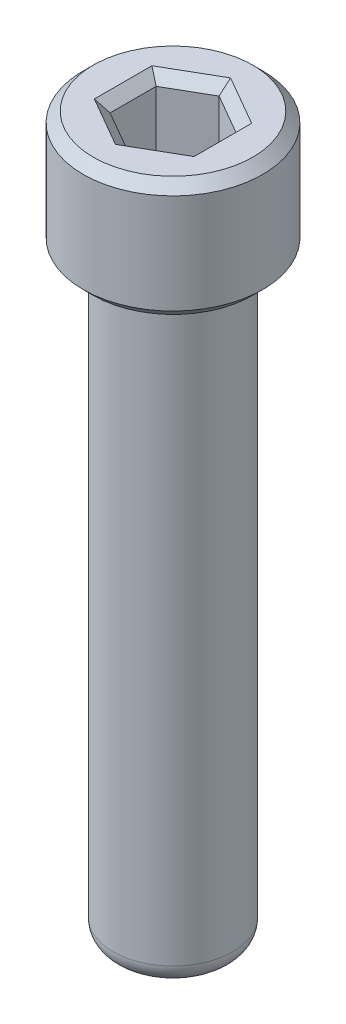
ISO-10303-21;
HEADER;
FILE_DESCRIPTION(('STEP AP214'),'2;1');
FILE_NAME('part.step','',(''),(''),'','','');
FILE_SCHEMA(('AUTOMOTIVE_DESIGN { 1 0 10303 214 1 1 1 1 }'));
ENDSEC;
DATA;
#1=APPLICATION_CONTEXT('core data for automotive mechanical design processes');
#2=APPLICATION_PROTOCOL_DEFINITION('international standard','automotive_design',2000,#1);
#3=PRODUCT_CONTEXT('',#1,'mechanical');
#4=PRODUCT('Part','Part','',(#3));
#5=PRODUCT_RELATED_PRODUCT_CATEGORY('part','',(#4));
#6=PRODUCT_DEFINITION_FORMATION('','',#4);
#7=PRODUCT_DEFINITION_CONTEXT('part definition',#1,'design');
#8=PRODUCT_DEFINITION('design','',#6,#7);
#9=PRODUCT_DEFINITION_SHAPE('','',#8);
#10=(LENGTH_UNIT() NAMED_UNIT(*) SI_UNIT(.MILLI.,.METRE.));
#11=(NAMED_UNIT(*) PLANE_ANGLE_UNIT() SI_UNIT($,.RADIAN.));
#12=(NAMED_UNIT(*) SI_UNIT($,.STERADIAN.) SOLID_ANGLE_UNIT());
#13=UNCERTAINTY_MEASURE_WITH_UNIT(LENGTH_MEASURE(1.E-05),#10,'distance_accuracy_value','');
#14=(GEOMETRIC_REPRESENTATION_CONTEXT(3) GLOBAL_UNCERTAINTY_ASSIGNED_CONTEXT((#13)) GLOBAL_UNIT_ASSIGNED_CONTEXT((#10,
#11,#12)) REPRESENTATION_CONTEXT('',''));
#15=CARTESIAN_POINT('',(0.,0.,0.));
#16=DIRECTION('',(0.,0.,1.));
#17=DIRECTION('',(1.,0.,0.));
#18=AXIS2_PLACEMENT_3D('',#15,#16,#17);
#19=CARTESIAN_POINT('',(0.,15.,0.));
#20=DIRECTION('',(0.,-1.,0.));
#21=DIRECTION('',(0.,0.,-1.));
#22=AXIS2_PLACEMENT_3D('',#19,#20,#21);
#23=CYLINDRICAL_SURFACE('',#22,1.5);
#24=CARTESIAN_POINT('',(0.,0.5,0.));
#25=DIRECTION('',(0.,1.,0.));
#26=DIRECTION('',(0.,0.,1.));
#27=AXIS2_PLACEMENT_3D('',#24,#25,#26);
#28=CIRCLE('',#27,1.5);
#29=CARTESIAN_POINT('',(0.,0.5,1.5));
#30=VERTEX_POINT('',#29);
#31=EDGE_CURVE('E56',#30,#30,#28,.T.);
#32=ORIENTED_EDGE('',*,*,#31,.T.);
#33=EDGE_LOOP('',(#32));
#34=FACE_BOUND('',#33,.T.);
#35=CARTESIAN_POINT('',(0.,15.,0.));
#36=DIRECTION('',(0.,1.,0.));
#37=DIRECTION('',(0.,0.,1.));
#38=AXIS2_PLACEMENT_3D('',#35,#36,#37);
#39=CIRCLE('',#38,1.5);
#40=CARTESIAN_POINT('',(0.,15.,1.5));
#41=VERTEX_POINT('',#40);
#42=EDGE_CURVE('E169',#41,#41,#39,.T.);
#43=ORIENTED_EDGE('',*,*,#42,.F.);
#44=EDGE_LOOP('',(#43));
#45=FACE_BOUND('',#44,.T.);
#46=ADVANCED_FACE('F47',(#34,#45),#23,.T.);
#47=CARTESIAN_POINT('',(0.,0.,0.));
#48=DIRECTION('',(0.,1.,0.));
#49=DIRECTION('',(0.,0.,1.));
#50=AXIS2_PLACEMENT_3D('',#47,#48,#49);
#51=PLANE('',#50);
#52=CARTESIAN_POINT('',(0.,0.,0.));
#53=DIRECTION('',(0.,1.,0.));
#54=DIRECTION('',(0.,0.,1.));
#55=AXIS2_PLACEMENT_3D('',#52,#53,#54);
#56=CIRCLE('',#55,1.);
#57=CARTESIAN_POINT('',(0.,0.,1.));
#58=VERTEX_POINT('',#57);
#59=EDGE_CURVE('E11',#58,#58,#56,.F.);
#60=ORIENTED_EDGE('',*,*,#59,.T.);
#61=EDGE_LOOP('',(#60));
#62=FACE_BOUND('',#61,.T.);
#63=ADVANCED_FACE('F270',(#62),#51,.F.);
#64=CARTESIAN_POINT('',(0.,18.,0.));
#65=DIRECTION('',(0.,-1.,0.));
#66=DIRECTION('',(0.,0.,-1.));
#67=AXIS2_PLACEMENT_3D('',#64,#65,#66);
#68=CYLINDRICAL_SURFACE('',#67,2.25);
#69=CARTESIAN_POINT('',(0.,15.25,0.));
#70=DIRECTION('',(0.,1.,0.));
#71=DIRECTION('',(0.,0.,1.));
#72=AXIS2_PLACEMENT_3D('',#69,#70,#71);
#73=CIRCLE('',#72,2.25);
#74=CARTESIAN_POINT('',(0.,15.25,2.25));
#75=VERTEX_POINT('',#74);
#76=EDGE_CURVE('E189',#75,#75,#73,.T.);
#77=ORIENTED_EDGE('',*,*,#76,.T.);
#78=EDGE_LOOP('',(#77));
#79=FACE_BOUND('',#78,.T.);
#80=CARTESIAN_POINT('',(0.,17.75,0.));
#81=DIRECTION('',(0.,1.,0.));
#82=DIRECTION('',(0.,0.,1.));
#83=AXIS2_PLACEMENT_3D('',#80,#81,#82);
#84=CIRCLE('',#83,2.25);
#85=CARTESIAN_POINT('',(0.,17.75,2.25));
#86=VERTEX_POINT('',#85);
#87=EDGE_CURVE('E185',#86,#86,#84,.F.);
#88=ORIENTED_EDGE('',*,*,#87,.T.);
#89=EDGE_LOOP('',(#88));
#90=FACE_BOUND('',#89,.T.);
#91=ADVANCED_FACE('F274',(#79,#90),#68,.T.);
#92=CARTESIAN_POINT('',(0.,18.,0.));
#93=DIRECTION('',(0.,1.,0.));
#94=DIRECTION('',(0.,0.,1.));
#95=AXIS2_PLACEMENT_3D('',#92,#93,#94);
#96=PLANE('',#95);
#97=CARTESIAN_POINT('',(0.,18.,0.));
#98=DIRECTION('',(0.,1.,0.));
#99=DIRECTION('',(0.,0.,1.));
#100=AXIS2_PLACEMENT_3D('',#97,#98,#99);
#101=CIRCLE('',#100,2.);
#102=CARTESIAN_POINT('',(0.,18.,2.));
#103=VERTEX_POINT('',#102);
#104=EDGE_CURVE('E216',#103,#103,#101,.T.);
#105=ORIENTED_EDGE('',*,*,#104,.T.);
#106=EDGE_LOOP('',(#105));
#107=FACE_BOUND('',#106,.T.);
#108=DIRECTION('',(-0.866025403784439,0.,0.5));
#109=VECTOR('',#108,1.);
#110=CARTESIAN_POINT('',(0.124999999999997,18.,1.37120688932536));
#111=LINE('',#110,#109);
#112=CARTESIAN_POINT('',(1.25,18.,0.72168783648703));
#113=VERTEX_POINT('',#112);
#114=CARTESIAN_POINT('',(0.,18.,1.44337567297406));
#115=VERTEX_POINT('',#114);
#116=EDGE_CURVE('E197',#113,#115,#111,.T.);
#117=ORIENTED_EDGE('',*,*,#116,.T.);
#118=DIRECTION('',(-0.866025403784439,0.,-0.5));
#119=VECTOR('',#118,1.);
#120=CARTESIAN_POINT('',(-1.125,18.,0.793856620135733));
#121=LINE('',#120,#119);
#122=CARTESIAN_POINT('',(-1.25,18.,0.721687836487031));
#123=VERTEX_POINT('',#122);
#124=EDGE_CURVE('E212',#115,#123,#121,.T.);
#125=ORIENTED_EDGE('',*,*,#124,.T.);
#126=DIRECTION('',(0.,0.,-1.));
#127=VECTOR('',#126,1.);
#128=CARTESIAN_POINT('',(-1.25,18.,-0.577350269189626));
#129=LINE('',#128,#127);
#130=CARTESIAN_POINT('',(-1.25,18.,-0.721687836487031));
#131=VERTEX_POINT('',#130);
#132=EDGE_CURVE('E209',#123,#131,#129,.T.);
#133=ORIENTED_EDGE('',*,*,#132,.T.);
#134=DIRECTION('',(0.866025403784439,0.,-0.5));
#135=VECTOR('',#134,1.);
#136=CARTESIAN_POINT('',(-0.124999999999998,18.,-1.37120688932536));
#137=LINE('',#136,#135);
#138=CARTESIAN_POINT('',(0.,18.,-1.44337567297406));
#139=VERTEX_POINT('',#138);
#140=EDGE_CURVE('E206',#131,#139,#137,.T.);
#141=ORIENTED_EDGE('',*,*,#140,.T.);
#142=DIRECTION('',(0.866025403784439,0.,0.5));
#143=VECTOR('',#142,1.);
#144=CARTESIAN_POINT('',(1.125,18.,-0.793856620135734));
#145=LINE('',#144,#143);
#146=CARTESIAN_POINT('',(1.25,18.,-0.721687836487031));
#147=VERTEX_POINT('',#146);
#148=EDGE_CURVE('E203',#139,#147,#145,.T.);
#149=ORIENTED_EDGE('',*,*,#148,.T.);
#150=DIRECTION('',(0.,0.,1.));
#151=VECTOR('',#150,1.);
#152=CARTESIAN_POINT('',(1.25,18.,0.577350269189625));
#153=LINE('',#152,#151);
#154=EDGE_CURVE('E200',#147,#113,#153,.T.);
#155=ORIENTED_EDGE('',*,*,#154,.T.);
#156=EDGE_LOOP('',(#117,#125,#133,#141,#149,#155));
#157=FACE_BOUND('',#156,.T.);
#158=ADVANCED_FACE('F336',(#107,#157),#96,.T.);
#159=CARTESIAN_POINT('',(0.,15.,0.));
#160=DIRECTION('',(0.,1.,0.));
#161=DIRECTION('',(0.,0.,1.));
#162=AXIS2_PLACEMENT_3D('',#159,#160,#161);
#163=PLANE('',#162);
#164=CARTESIAN_POINT('',(0.,15.,0.));
#165=DIRECTION('',(0.,1.,0.));
#166=DIRECTION('',(0.,0.,1.));
#167=AXIS2_PLACEMENT_3D('',#164,#165,#166);
#168=CIRCLE('',#167,2.);
#169=CARTESIAN_POINT('',(0.,15.,2.));
#170=VERTEX_POINT('',#169);
#171=EDGE_CURVE('E193',#170,#170,#168,.F.);
#172=ORIENTED_EDGE('',*,*,#171,.T.);
#173=EDGE_LOOP('',(#172));
#174=FACE_BOUND('',#173,.T.);
#175=ORIENTED_EDGE('',*,*,#42,.T.);
#176=EDGE_LOOP('',(#175));
#177=FACE_BOUND('',#176,.T.);
#178=ADVANCED_FACE('F370',(#174,#177),#163,.F.);
#179=CARTESIAN_POINT('',(1.,16.,-0.577350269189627));
#180=DIRECTION('',(0.5,0.,-0.866025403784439));
#181=DIRECTION('',(-0.866025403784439,0.,-0.5));
#182=AXIS2_PLACEMENT_3D('',#179,#180,#181);
#183=PLANE('',#182);
#184=DIRECTION('',(0.,1.,0.));
#185=VECTOR('',#184,1.);
#186=CARTESIAN_POINT('',(1.,16.,-0.577350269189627));
#187=LINE('',#186,#185);
#188=CARTESIAN_POINT('',(1.,16.,-0.577350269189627));
#189=VERTEX_POINT('',#188);
#190=CARTESIAN_POINT('',(1.,17.75,-0.577350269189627));
#191=VERTEX_POINT('',#190);
#192=EDGE_CURVE('E166',#189,#191,#187,.T.);
#193=ORIENTED_EDGE('',*,*,#192,.T.);
#194=DIRECTION('',(-0.866025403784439,0.,-0.5));
#195=VECTOR('',#194,1.);
#196=CARTESIAN_POINT('',(0.,17.75,-1.15470053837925));
#197=LINE('',#196,#195);
#198=CARTESIAN_POINT('',(0.,17.75,-1.15470053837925));
#199=VERTEX_POINT('',#198);
#200=EDGE_CURVE('E127',#191,#199,#197,.T.);
#201=ORIENTED_EDGE('',*,*,#200,.T.);
#202=DIRECTION('',(0.,1.,0.));
#203=VECTOR('',#202,1.);
#204=CARTESIAN_POINT('',(0.,16.,-1.15470053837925));
#205=LINE('',#204,#203);
#206=CARTESIAN_POINT('',(0.,16.,-1.15470053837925));
#207=VERTEX_POINT('',#206);
#208=EDGE_CURVE('E120',#207,#199,#205,.T.);
#209=ORIENTED_EDGE('',*,*,#208,.F.);
#210=DIRECTION('',(-0.866025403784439,0.,-0.5));
#211=VECTOR('',#210,1.);
#212=CARTESIAN_POINT('',(1.,16.,-0.577350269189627));
#213=LINE('',#212,#211);
#214=EDGE_CURVE('E124',#189,#207,#213,.T.);
#215=ORIENTED_EDGE('',*,*,#214,.F.);
#216=EDGE_LOOP('',(#193,#201,#209,#215));
#217=FACE_BOUND('',#216,.T.);
#218=ADVANCED_FACE('F122',(#217),#183,.F.);
#219=CARTESIAN_POINT('',(1.,16.,0.577350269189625));
#220=DIRECTION('',(1.,0.,0.));
#221=DIRECTION('',(0.,0.,-1.));
#222=AXIS2_PLACEMENT_3D('',#219,#220,#221);
#223=PLANE('',#222);
#224=DIRECTION('',(0.,1.,0.));
#225=VECTOR('',#224,1.);
#226=CARTESIAN_POINT('',(1.,16.,0.577350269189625));
#227=LINE('',#226,#225);
#228=CARTESIAN_POINT('',(1.,16.,0.577350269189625));
#229=VERTEX_POINT('',#228);
#230=CARTESIAN_POINT('',(1.,17.75,0.577350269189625));
#231=VERTEX_POINT('',#230);
#232=EDGE_CURVE('E170',#229,#231,#227,.T.);
#233=ORIENTED_EDGE('',*,*,#232,.T.);
#234=DIRECTION('',(0.,0.,-1.));
#235=VECTOR('',#234,1.);
#236=CARTESIAN_POINT('',(1.,17.75,-0.577350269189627));
#237=LINE('',#236,#235);
#238=EDGE_CURVE('E70',#231,#191,#237,.T.);
#239=ORIENTED_EDGE('',*,*,#238,.T.);
#240=ORIENTED_EDGE('',*,*,#192,.F.);
#241=DIRECTION('',(0.,0.,-1.));
#242=VECTOR('',#241,1.);
#243=CARTESIAN_POINT('',(1.,16.,0.577350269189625));
#244=LINE('',#243,#242);
#245=EDGE_CURVE('E132',#229,#189,#244,.T.);
#246=ORIENTED_EDGE('',*,*,#245,.F.);
#247=EDGE_LOOP('',(#233,#239,#240,#246));
#248=FACE_BOUND('',#247,.T.);
#249=ADVANCED_FACE('F351',(#248),#223,.F.);
#250=CARTESIAN_POINT('',(0.,16.,1.15470053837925));
#251=DIRECTION('',(0.5,0.,0.866025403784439));
#252=DIRECTION('',(0.866025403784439,0.,-0.5));
#253=AXIS2_PLACEMENT_3D('',#250,#251,#252);
#254=PLANE('',#253);
#255=DIRECTION('',(0.,1.,0.));
#256=VECTOR('',#255,1.);
#257=CARTESIAN_POINT('',(0.,16.,1.15470053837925));
#258=LINE('',#257,#256);
#259=CARTESIAN_POINT('',(0.,16.,1.15470053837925));
#260=VERTEX_POINT('',#259);
#261=CARTESIAN_POINT('',(0.,17.75,1.15470053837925));
#262=VERTEX_POINT('',#261);
#263=EDGE_CURVE('E173',#260,#262,#258,.T.);
#264=ORIENTED_EDGE('',*,*,#263,.T.);
#265=DIRECTION('',(0.866025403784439,0.,-0.5));
#266=VECTOR('',#265,1.);
#267=CARTESIAN_POINT('',(1.,17.75,0.577350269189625));
#268=LINE('',#267,#266);
#269=EDGE_CURVE('E63',#262,#231,#268,.T.);
#270=ORIENTED_EDGE('',*,*,#269,.T.);
#271=ORIENTED_EDGE('',*,*,#232,.F.);
#272=DIRECTION('',(0.866025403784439,0.,-0.5));
#273=VECTOR('',#272,1.);
#274=CARTESIAN_POINT('',(0.,16.,1.15470053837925));
#275=LINE('',#274,#273);
#276=EDGE_CURVE('E161',#260,#229,#275,.T.);
#277=ORIENTED_EDGE('',*,*,#276,.F.);
#278=EDGE_LOOP('',(#264,#270,#271,#277));
#279=FACE_BOUND('',#278,.T.);
#280=ADVANCED_FACE('F353',(#279),#254,.F.);
#281=CARTESIAN_POINT('',(-1.,16.,0.577350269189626));
#282=DIRECTION('',(-0.5,0.,0.866025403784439));
#283=DIRECTION('',(0.866025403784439,0.,0.5));
#284=AXIS2_PLACEMENT_3D('',#281,#282,#283);
#285=PLANE('',#284);
#286=DIRECTION('',(0.,1.,0.));
#287=VECTOR('',#286,1.);
#288=CARTESIAN_POINT('',(-1.,16.,0.577350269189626));
#289=LINE('',#288,#287);
#290=CARTESIAN_POINT('',(-1.,16.,0.577350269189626));
#291=VERTEX_POINT('',#290);
#292=CARTESIAN_POINT('',(-1.,17.75,0.577350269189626));
#293=VERTEX_POINT('',#292);
#294=EDGE_CURVE('E176',#291,#293,#289,.T.);
#295=ORIENTED_EDGE('',*,*,#294,.T.);
#296=DIRECTION('',(0.866025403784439,0.,0.5));
#297=VECTOR('',#296,1.);
#298=CARTESIAN_POINT('',(0.,17.75,1.15470053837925));
#299=LINE('',#298,#297);
#300=EDGE_CURVE('E220',#293,#262,#299,.T.);
#301=ORIENTED_EDGE('',*,*,#300,.T.);
#302=ORIENTED_EDGE('',*,*,#263,.F.);
#303=DIRECTION('',(0.866025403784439,0.,0.5));
#304=VECTOR('',#303,1.);
#305=CARTESIAN_POINT('',(-1.,16.,0.577350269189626));
#306=LINE('',#305,#304);
#307=EDGE_CURVE('E157',#291,#260,#306,.T.);
#308=ORIENTED_EDGE('',*,*,#307,.F.);
#309=EDGE_LOOP('',(#295,#301,#302,#308));
#310=FACE_BOUND('',#309,.T.);
#311=ADVANCED_FACE('F349',(#310),#285,.F.);
#312=CARTESIAN_POINT('',(-1.,16.,-0.577350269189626));
#313=DIRECTION('',(-1.,0.,0.));
#314=DIRECTION('',(0.,0.,1.));
#315=AXIS2_PLACEMENT_3D('',#312,#313,#314);
#316=PLANE('',#315);
#317=DIRECTION('',(0.,1.,0.));
#318=VECTOR('',#317,1.);
#319=CARTESIAN_POINT('',(-1.,16.,-0.577350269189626));
#320=LINE('',#319,#318);
#321=CARTESIAN_POINT('',(-1.,16.,-0.577350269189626));
#322=VERTEX_POINT('',#321);
#323=CARTESIAN_POINT('',(-1.,17.75,-0.577350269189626));
#324=VERTEX_POINT('',#323);
#325=EDGE_CURVE('E131',#322,#324,#320,.T.);
#326=ORIENTED_EDGE('',*,*,#325,.T.);
#327=DIRECTION('',(0.,0.,1.));
#328=VECTOR('',#327,1.);
#329=CARTESIAN_POINT('',(-1.,17.75,0.577350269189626));
#330=LINE('',#329,#328);
#331=EDGE_CURVE('E224',#324,#293,#330,.T.);
#332=ORIENTED_EDGE('',*,*,#331,.T.);
#333=ORIENTED_EDGE('',*,*,#294,.F.);
#334=DIRECTION('',(0.,0.,1.));
#335=VECTOR('',#334,1.);
#336=CARTESIAN_POINT('',(-1.,16.,-0.577350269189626));
#337=LINE('',#336,#335);
#338=EDGE_CURVE('E142',#322,#291,#337,.T.);
#339=ORIENTED_EDGE('',*,*,#338,.F.);
#340=EDGE_LOOP('',(#326,#332,#333,#339));
#341=FACE_BOUND('',#340,.T.);
#342=ADVANCED_FACE('F346',(#341),#316,.F.);
#343=CARTESIAN_POINT('',(0.,16.,-1.15470053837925));
#344=DIRECTION('',(-0.5,0.,-0.866025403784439));
#345=DIRECTION('',(-0.866025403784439,0.,0.5));
#346=AXIS2_PLACEMENT_3D('',#343,#344,#345);
#347=PLANE('',#346);
#348=ORIENTED_EDGE('',*,*,#208,.T.);
#349=DIRECTION('',(-0.866025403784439,0.,0.5));
#350=VECTOR('',#349,1.);
#351=CARTESIAN_POINT('',(-1.,17.75,-0.577350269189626));
#352=LINE('',#351,#350);
#353=EDGE_CURVE('E227',#199,#324,#352,.T.);
#354=ORIENTED_EDGE('',*,*,#353,.T.);
#355=ORIENTED_EDGE('',*,*,#325,.F.);
#356=DIRECTION('',(-0.866025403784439,0.,0.5));
#357=VECTOR('',#356,1.);
#358=CARTESIAN_POINT('',(0.,16.,-1.15470053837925));
#359=LINE('',#358,#357);
#360=EDGE_CURVE('E135',#207,#322,#359,.T.);
#361=ORIENTED_EDGE('',*,*,#360,.F.);
#362=EDGE_LOOP('',(#348,#354,#355,#361));
#363=FACE_BOUND('',#362,.T.);
#364=ADVANCED_FACE('F136',(#363),#347,.F.);
#365=CARTESIAN_POINT('',(0.,16.,0.));
#366=DIRECTION('',(0.,1.,0.));
#367=DIRECTION('',(0.,0.,1.));
#368=AXIS2_PLACEMENT_3D('',#365,#366,#367);
#369=PLANE('',#368);
#370=ORIENTED_EDGE('',*,*,#214,.T.);
#371=ORIENTED_EDGE('',*,*,#360,.T.);
#372=ORIENTED_EDGE('',*,*,#338,.T.);
#373=ORIENTED_EDGE('',*,*,#307,.T.);
#374=ORIENTED_EDGE('',*,*,#276,.T.);
#375=ORIENTED_EDGE('',*,*,#245,.T.);
#376=EDGE_LOOP('',(#370,#371,#372,#373,#374,#375));
#377=FACE_BOUND('',#376,.T.);
#378=ADVANCED_FACE('F144',(#377),#369,.T.);
#379=CARTESIAN_POINT('',(0.,15.25,0.));
#380=DIRECTION('',(0.,1.,0.));
#381=DIRECTION('',(0.,0.,1.));
#382=AXIS2_PLACEMENT_3D('',#379,#380,#381);
#383=CONICAL_SURFACE('',#382,2.25,0.785398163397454);
#384=ORIENTED_EDGE('',*,*,#171,.F.);
#385=EDGE_LOOP('',(#384));
#386=FACE_BOUND('',#385,.T.);
#387=ORIENTED_EDGE('',*,*,#76,.F.);
#388=EDGE_LOOP('',(#387));
#389=FACE_BOUND('',#388,.T.);
#390=ADVANCED_FACE('F280',(#386,#389),#383,.T.);
#391=CARTESIAN_POINT('',(0.,18.,0.));
#392=DIRECTION('',(0.,-1.,0.));
#393=DIRECTION('',(0.,0.,-1.));
#394=AXIS2_PLACEMENT_3D('',#391,#392,#393);
#395=CONICAL_SURFACE('',#394,2.,0.785398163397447);
#396=ORIENTED_EDGE('',*,*,#87,.F.);
#397=EDGE_LOOP('',(#396));
#398=FACE_BOUND('',#397,.T.);
#399=ORIENTED_EDGE('',*,*,#104,.F.);
#400=EDGE_LOOP('',(#399));
#401=FACE_BOUND('',#400,.T.);
#402=ADVANCED_FACE('F286',(#398,#401),#395,.T.);
#403=CARTESIAN_POINT('',(1.,17.75,-0.577350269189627));
#404=DIRECTION('',(-0.353553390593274,0.707106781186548,0.612372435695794));
#405=DIRECTION('',(0.866025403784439,0.,0.5));
#406=AXIS2_PLACEMENT_3D('',#403,#404,#405);
#407=PLANE('',#406);
#408=DIRECTION('',(-0.654653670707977,-0.654653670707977,0.377964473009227));
#409=VECTOR('',#408,1.);
#410=CARTESIAN_POINT('',(1.,17.75,-0.577350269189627));
#411=LINE('',#410,#409);
#412=EDGE_CURVE('E152',#147,#191,#411,.T.);
#413=ORIENTED_EDGE('',*,*,#412,.F.);
#414=ORIENTED_EDGE('',*,*,#148,.F.);
#415=DIRECTION('',(0.,-0.654653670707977,0.755928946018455));
#416=VECTOR('',#415,1.);
#417=CARTESIAN_POINT('',(0.,17.75,-1.15470053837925));
#418=LINE('',#417,#416);
#419=EDGE_CURVE('E148',#199,#139,#418,.F.);
#420=ORIENTED_EDGE('',*,*,#419,.F.);
#421=ORIENTED_EDGE('',*,*,#200,.F.);
#422=EDGE_LOOP('',(#413,#414,#420,#421));
#423=FACE_BOUND('',#422,.T.);
#424=ADVANCED_FACE('F292',(#423),#407,.T.);
#425=CARTESIAN_POINT('',(0.,17.75,-1.15470053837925));
#426=DIRECTION('',(0.353553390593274,0.707106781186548,0.612372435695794));
#427=DIRECTION('',(0.866025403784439,0.,-0.5));
#428=AXIS2_PLACEMENT_3D('',#425,#426,#427);
#429=PLANE('',#428);
#430=ORIENTED_EDGE('',*,*,#419,.T.);
#431=ORIENTED_EDGE('',*,*,#140,.F.);
#432=DIRECTION('',(0.654653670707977,-0.654653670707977,0.377964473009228));
#433=VECTOR('',#432,1.);
#434=CARTESIAN_POINT('',(-1.,17.75,-0.577350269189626));
#435=LINE('',#434,#433);
#436=EDGE_CURVE('E246',#324,#131,#435,.F.);
#437=ORIENTED_EDGE('',*,*,#436,.F.);
#438=ORIENTED_EDGE('',*,*,#353,.F.);
#439=EDGE_LOOP('',(#430,#431,#437,#438));
#440=FACE_BOUND('',#439,.T.);
#441=ADVANCED_FACE('F318',(#440),#429,.T.);
#442=CARTESIAN_POINT('',(1.,17.75,0.577350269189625));
#443=DIRECTION('',(-0.707106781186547,0.707106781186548,0.));
#444=DIRECTION('',(0.,0.,1.));
#445=AXIS2_PLACEMENT_3D('',#442,#443,#444);
#446=PLANE('',#445);
#447=ORIENTED_EDGE('',*,*,#412,.T.);
#448=ORIENTED_EDGE('',*,*,#238,.F.);
#449=DIRECTION('',(-0.654653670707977,-0.654653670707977,-0.377964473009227));
#450=VECTOR('',#449,1.);
#451=CARTESIAN_POINT('',(1.,17.75,0.577350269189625));
#452=LINE('',#451,#450);
#453=EDGE_CURVE('E242',#113,#231,#452,.T.);
#454=ORIENTED_EDGE('',*,*,#453,.F.);
#455=ORIENTED_EDGE('',*,*,#154,.F.);
#456=EDGE_LOOP('',(#447,#448,#454,#455));
#457=FACE_BOUND('',#456,.T.);
#458=ADVANCED_FACE('F311',(#457),#446,.T.);
#459=CARTESIAN_POINT('',(-1.,17.75,-0.577350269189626));
#460=DIRECTION('',(0.707106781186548,0.707106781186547,0.));
#461=DIRECTION('',(0.,0.,-1.));
#462=AXIS2_PLACEMENT_3D('',#459,#460,#461);
#463=PLANE('',#462);
#464=ORIENTED_EDGE('',*,*,#436,.T.);
#465=ORIENTED_EDGE('',*,*,#132,.F.);
#466=DIRECTION('',(0.654653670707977,-0.654653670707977,-0.377964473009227));
#467=VECTOR('',#466,1.);
#468=CARTESIAN_POINT('',(-1.,17.75,0.577350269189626));
#469=LINE('',#468,#467);
#470=EDGE_CURVE('E239',#293,#123,#469,.F.);
#471=ORIENTED_EDGE('',*,*,#470,.F.);
#472=ORIENTED_EDGE('',*,*,#331,.F.);
#473=EDGE_LOOP('',(#464,#465,#471,#472));
#474=FACE_BOUND('',#473,.T.);
#475=ADVANCED_FACE('F304',(#474),#463,.T.);
#476=CARTESIAN_POINT('',(0.,17.75,1.15470053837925));
#477=DIRECTION('',(-0.353553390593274,0.707106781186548,-0.612372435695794));
#478=DIRECTION('',(-0.866025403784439,0.,0.5));
#479=AXIS2_PLACEMENT_3D('',#476,#477,#478);
#480=PLANE('',#479);
#481=ORIENTED_EDGE('',*,*,#453,.T.);
#482=ORIENTED_EDGE('',*,*,#269,.F.);
#483=DIRECTION('',(0.,0.654653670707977,0.755928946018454));
#484=VECTOR('',#483,1.);
#485=CARTESIAN_POINT('',(0.,17.4642857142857,0.824786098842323));
#486=LINE('',#485,#484);
#487=EDGE_CURVE('E236',#115,#262,#486,.F.);
#488=ORIENTED_EDGE('',*,*,#487,.F.);
#489=ORIENTED_EDGE('',*,*,#116,.F.);
#490=EDGE_LOOP('',(#481,#482,#488,#489));
#491=FACE_BOUND('',#490,.T.);
#492=ADVANCED_FACE('F265',(#491),#480,.T.);
#493=CARTESIAN_POINT('',(-1.,17.75,0.577350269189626));
#494=DIRECTION('',(0.353553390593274,0.707106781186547,-0.612372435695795));
#495=DIRECTION('',(-0.866025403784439,0.,-0.5));
#496=AXIS2_PLACEMENT_3D('',#493,#494,#495);
#497=PLANE('',#496);
#498=ORIENTED_EDGE('',*,*,#470,.T.);
#499=ORIENTED_EDGE('',*,*,#124,.F.);
#500=ORIENTED_EDGE('',*,*,#487,.T.);
#501=ORIENTED_EDGE('',*,*,#300,.F.);
#502=EDGE_LOOP('',(#498,#499,#500,#501));
#503=FACE_BOUND('',#502,.T.);
#504=ADVANCED_FACE('F259',(#503),#497,.T.);
#505=CARTESIAN_POINT('',(0.,0.5,0.));
#506=DIRECTION('',(0.,1.,0.));
#507=DIRECTION('',(0.,0.,1.));
#508=AXIS2_PLACEMENT_3D('',#505,#506,#507);
#509=TOROIDAL_SURFACE('',#508,1.,0.5);
#510=ORIENTED_EDGE('',*,*,#59,.F.);
#511=EDGE_LOOP('',(#510));
#512=FACE_BOUND('',#511,.T.);
#513=ORIENTED_EDGE('',*,*,#31,.F.);
#514=EDGE_LOOP('',(#513));
#515=FACE_BOUND('',#514,.T.);
#516=ADVANCED_FACE('F49',(#512,#515),#509,.T.);
#517=CLOSED_SHELL('',(#46,#63,#91,#158,#178,#218,#249,#280,#311,#342,#364,#378,#390,#402,#424,
#441,#458,#475,#492,#504,#516));
#518=MANIFOLD_SOLID_BREP('B2',#517);
#519=ADVANCED_BREP_SHAPE_REPRESENTATION('',(#18,#518),#14);
#520=SHAPE_DEFINITION_REPRESENTATION(#9,#519);
ENDSEC;
END-ISO-10303-21;
